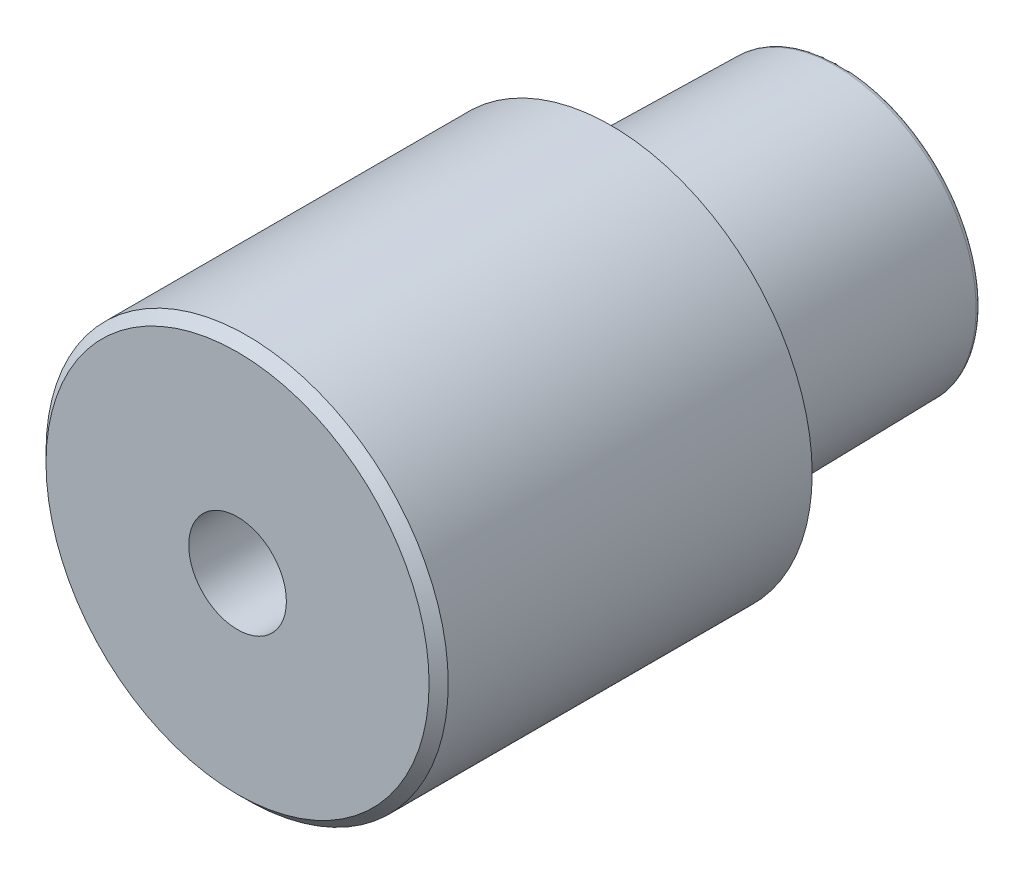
ISO-10303-21;
HEADER;
FILE_DESCRIPTION(('STEP AP214'),'2;1');
FILE_NAME('part.step','',(''),(''),'','','');
FILE_SCHEMA(('AUTOMOTIVE_DESIGN { 1 0 10303 214 1 1 1 1 }'));
ENDSEC;
DATA;
#1=APPLICATION_CONTEXT('core data for automotive mechanical design processes');
#2=APPLICATION_PROTOCOL_DEFINITION('international standard','automotive_design',2000,#1);
#3=PRODUCT_CONTEXT('',#1,'mechanical');
#4=PRODUCT('Part','Part','',(#3));
#5=PRODUCT_RELATED_PRODUCT_CATEGORY('part','',(#4));
#6=PRODUCT_DEFINITION_FORMATION('','',#4);
#7=PRODUCT_DEFINITION_CONTEXT('part definition',#1,'design');
#8=PRODUCT_DEFINITION('design','',#6,#7);
#9=PRODUCT_DEFINITION_SHAPE('','',#8);
#10=(LENGTH_UNIT() NAMED_UNIT(*) SI_UNIT(.MILLI.,.METRE.));
#11=(NAMED_UNIT(*) PLANE_ANGLE_UNIT() SI_UNIT($,.RADIAN.));
#12=(NAMED_UNIT(*) SI_UNIT($,.STERADIAN.) SOLID_ANGLE_UNIT());
#13=UNCERTAINTY_MEASURE_WITH_UNIT(LENGTH_MEASURE(1.E-05),#10,'distance_accuracy_value','');
#14=(GEOMETRIC_REPRESENTATION_CONTEXT(3) GLOBAL_UNCERTAINTY_ASSIGNED_CONTEXT((#13)) GLOBAL_UNIT_ASSIGNED_CONTEXT((#10,
#11,#12)) REPRESENTATION_CONTEXT('',''));
#15=CARTESIAN_POINT('',(0.,0.,0.));
#16=DIRECTION('',(0.,0.,1.));
#17=DIRECTION('',(1.,0.,0.));
#18=AXIS2_PLACEMENT_3D('',#15,#16,#17);
#19=CARTESIAN_POINT('',(2.11594349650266E-13,0.,30.301515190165));
#20=DIRECTION('',(0.,0.,-1.));
#21=DIRECTION('',(1.,0.,0.));
#22=AXIS2_PLACEMENT_3D('',#19,#20,#21);
#23=CONICAL_SURFACE('',#22,29.698484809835,0.785398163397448);
#24=CARTESIAN_POINT('',(2.7931850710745E-13,0.,40.));
#25=DIRECTION('',(0.,0.,-1.));
#26=DIRECTION('',(-1.,0.,0.));
#27=AXIS2_PLACEMENT_3D('',#24,#25,#26);
#28=CIRCLE('',#27,20.);
#29=CARTESIAN_POINT('',(-19.9999999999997,0.,40.));
#30=VERTEX_POINT('',#29);
#31=CARTESIAN_POINT('',(20.0000000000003,0.,40.));
#32=VERTEX_POINT('',#31);
#33=EDGE_CURVE('E59',#30,#32,#28,.T.);
#34=ORIENTED_EDGE('',*,*,#33,.T.);
#35=CARTESIAN_POINT('',(20.0000025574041,0.,39.9999974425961));
#36=CARTESIAN_POINT('',(21.0000013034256,0.,38.9999986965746));
#37=B_SPLINE_CURVE_WITH_KNOTS('',1,(#35,#36),.UNSPECIFIED.,.F.,.F.,(2,2),(0.673435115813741,
0.707106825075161),.UNSPECIFIED.);
#38=CARTESIAN_POINT('',(21.0000000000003,0.,39.));
#39=VERTEX_POINT('',#38);
#40=EDGE_CURVE('E46',#32,#39,#37,.T.);
#41=ORIENTED_EDGE('',*,*,#40,.T.);
#42=CARTESIAN_POINT('',(2.72335544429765E-13,0.,39.));
#43=DIRECTION('',(0.,0.,1.));
#44=DIRECTION('',(-1.,0.,0.));
#45=AXIS2_PLACEMENT_3D('',#42,#43,#44);
#46=CIRCLE('',#45,21.);
#47=CARTESIAN_POINT('',(-20.9999999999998,0.,39.));
#48=VERTEX_POINT('',#47);
#49=EDGE_CURVE('E97',#39,#48,#46,.T.);
#50=ORIENTED_EDGE('',*,*,#49,.T.);
#51=CARTESIAN_POINT('',(2.72335544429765E-13,0.,39.));
#52=DIRECTION('',(0.,0.,1.));
#53=DIRECTION('',(-1.,0.,0.));
#54=AXIS2_PLACEMENT_3D('',#51,#52,#53);
#55=CIRCLE('',#54,21.);
#56=EDGE_CURVE('E11',#48,#39,#55,.T.);
#57=ORIENTED_EDGE('',*,*,#56,.T.);
#58=ORIENTED_EDGE('',*,*,#40,.F.);
#59=CARTESIAN_POINT('',(2.7931850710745E-13,0.,40.));
#60=DIRECTION('',(0.,0.,-1.));
#61=DIRECTION('',(-1.,0.,0.));
#62=AXIS2_PLACEMENT_3D('',#59,#60,#61);
#63=CIRCLE('',#62,20.);
#64=EDGE_CURVE('E94',#32,#30,#63,.T.);
#65=ORIENTED_EDGE('',*,*,#64,.T.);
#66=EDGE_LOOP('',(#34,#41,#50,#57,#58,#65));
#67=FACE_BOUND('',#66,.T.);
#68=ADVANCED_FACE('F38',(#67),#23,.T.);
#69=CARTESIAN_POINT('',(1.43150734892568E-13,0.,20.5));
#70=DIRECTION('',(0.,0.,-1.));
#71=DIRECTION('',(-1.,0.,0.));
#72=AXIS2_PLACEMENT_3D('',#69,#70,#71);
#73=CYLINDRICAL_SURFACE('',#72,21.);
#74=ORIENTED_EDGE('',*,*,#49,.F.);
#75=ORIENTED_EDGE('',*,*,#56,.F.);
#76=CARTESIAN_POINT('',(-20.9999999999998,0.,39.0000014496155));
#77=CARTESIAN_POINT('',(-21.,0.,1.0000004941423));
#78=B_SPLINE_CURVE_WITH_KNOTS('',1,(#76,#77),.UNSPECIFIED.,.F.,.F.,(2,2),(0.0833333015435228,
0.916666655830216),.UNSPECIFIED.);
#79=CARTESIAN_POINT('',(-21.,0.,1.00000000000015));
#80=VERTEX_POINT('',#79);
#81=EDGE_CURVE('E132',#48,#80,#78,.T.);
#82=ORIENTED_EDGE('',*,*,#81,.T.);
#83=CARTESIAN_POINT('',(0.,0.,1.));
#84=DIRECTION('',(0.,0.,-1.));
#85=DIRECTION('',(-1.,0.,0.));
#86=AXIS2_PLACEMENT_3D('',#83,#84,#85);
#87=CIRCLE('',#86,21.);
#88=EDGE_CURVE('E137',#80,#80,#87,.T.);
#89=ORIENTED_EDGE('',*,*,#88,.F.);
#90=ORIENTED_EDGE('',*,*,#81,.F.);
#91=EDGE_LOOP('',(#74,#75,#82,#89,#90));
#92=FACE_BOUND('',#91,.T.);
#93=ADVANCED_FACE('F182',(#92),#73,.T.);
#94=CARTESIAN_POINT('',(-26.,-41.5692193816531,40.));
#95=DIRECTION('',(0.,0.,1.));
#96=DIRECTION('',(1.,0.,0.));
#97=AXIS2_PLACEMENT_3D('',#94,#95,#96);
#98=PLANE('',#97);
#99=CARTESIAN_POINT('',(0.,0.,39.9999999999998));
#100=DIRECTION('',(0.,0.,1.));
#101=DIRECTION('',(1.,0.,0.));
#102=AXIS2_PLACEMENT_3D('',#99,#100,#101);
#103=CIRCLE('',#102,5.09999999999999);
#104=CARTESIAN_POINT('',(5.09999999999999,0.,39.9999999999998));
#105=VERTEX_POINT('',#104);
#106=EDGE_CURVE('E95',#105,#105,#103,.T.);
#107=ORIENTED_EDGE('',*,*,#106,.F.);
#108=EDGE_LOOP('',(#107));
#109=FACE_BOUND('',#108,.T.);
#110=ORIENTED_EDGE('',*,*,#64,.F.);
#111=ORIENTED_EDGE('',*,*,#33,.F.);
#112=EDGE_LOOP('',(#110,#111));
#113=FACE_BOUND('',#112,.T.);
#114=ADVANCED_FACE('F185',(#109,#113),#98,.T.);
#115=CARTESIAN_POINT('',(-1.57116660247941E-13,0.,-22.5));
#116=DIRECTION('',(0.,0.,-1.));
#117=DIRECTION('',(-1.,0.,0.));
#118=AXIS2_PLACEMENT_3D('',#115,#116,#117);
#119=TOROIDAL_SURFACE('',#118,14.1071848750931,0.5);
#120=CARTESIAN_POINT('',(-1.57177594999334E-13,0.,-22.5087262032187));
#121=DIRECTION('',(0.,0.,-1.));
#122=DIRECTION('',(-1.,0.,0.));
#123=AXIS2_PLACEMENT_3D('',#120,#121,#122);
#124=CIRCLE('',#123,14.6071087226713);
#125=CARTESIAN_POINT('',(-14.6071087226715,0.,-22.5087262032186));
#126=VERTEX_POINT('',#125);
#127=EDGE_CURVE('E138',#126,#126,#124,.T.);
#128=ORIENTED_EDGE('',*,*,#127,.T.);
#129=CARTESIAN_POINT('',(-14.6071087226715,0.,-22.5087262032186));
#130=CARTESIAN_POINT('',(-14.5985335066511,0.,-22.9999999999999));
#131=CARTESIAN_POINT('',(-14.1071848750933,0.,-23.));
#132=(BOUNDED_CURVE() B_SPLINE_CURVE(2,(#129,#130,#131),.UNSPECIFIED.,.F.,
.F.) B_SPLINE_CURVE_WITH_KNOTS((3,3),(0.,0.5),
.UNSPECIFIED.) CURVE() GEOMETRIC_REPRESENTATION_ITEM() RATIONAL_B_SPLINE_CURVE((1.,
0.713250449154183,1.)) REPRESENTATION_ITEM(''));
#133=CARTESIAN_POINT('',(-14.1071848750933,0.,-23.));
#134=VERTEX_POINT('',#133);
#135=EDGE_CURVE('E121',#126,#134,#132,.T.);
#136=ORIENTED_EDGE('',*,*,#135,.T.);
#137=CARTESIAN_POINT('',(-1.60608141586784E-13,0.,-23.));
#138=DIRECTION('',(0.,0.,1.));
#139=DIRECTION('',(-1.,0.,0.));
#140=AXIS2_PLACEMENT_3D('',#137,#138,#139);
#141=CIRCLE('',#140,14.1071848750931);
#142=EDGE_CURVE('E127',#134,#134,#141,.T.);
#143=ORIENTED_EDGE('',*,*,#142,.T.);
#144=ORIENTED_EDGE('',*,*,#135,.F.);
#145=EDGE_LOOP('',(#128,#136,#143,#144));
#146=FACE_BOUND('',#145,.T.);
#147=ADVANCED_FACE('F187',(#146),#119,.T.);
#148=CARTESIAN_POINT('',(0.,0.,0.));
#149=DIRECTION('',(0.,0.,1.));
#150=DIRECTION('',(-1.,0.,0.));
#151=AXIS2_PLACEMENT_3D('',#148,#149,#150);
#152=CONICAL_SURFACE('',#151,15.,0.0174532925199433);
#153=ORIENTED_EDGE('',*,*,#127,.F.);
#154=CARTESIAN_POINT('',(-14.6071087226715,0.,-22.5087262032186));
#155=CARTESIAN_POINT('',(-15.,0.,1.04744440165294E-13));
#156=B_SPLINE_CURVE_WITH_KNOTS('',1,(#154,#155),.UNSPECIFIED.,.F.,.F.,(2,2),(0.,1.),.UNSPECIFIED.);
#157=CARTESIAN_POINT('',(-15.,0.,1.04744440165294E-13));
#158=VERTEX_POINT('',#157);
#159=EDGE_CURVE('E110',#126,#158,#156,.T.);
#160=ORIENTED_EDGE('',*,*,#159,.T.);
#161=CARTESIAN_POINT('',(0.,0.,0.));
#162=DIRECTION('',(0.,0.,-1.));
#163=DIRECTION('',(-1.,0.,0.));
#164=AXIS2_PLACEMENT_3D('',#161,#162,#163);
#165=CIRCLE('',#164,15.);
#166=EDGE_CURVE('E116',#158,#158,#165,.T.);
#167=ORIENTED_EDGE('',*,*,#166,.T.);
#168=ORIENTED_EDGE('',*,*,#159,.F.);
#169=EDGE_LOOP('',(#153,#160,#167,#168));
#170=FACE_BOUND('',#169,.T.);
#171=ADVANCED_FACE('F194',(#170),#152,.T.);
#172=CARTESIAN_POINT('',(32.4465252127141,-29.3212331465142,-23.0000000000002));
#173=DIRECTION('',(0.,0.,-1.));
#174=DIRECTION('',(-1.,0.,0.));
#175=AXIS2_PLACEMENT_3D('',#172,#173,#174);
#176=PLANE('',#175);
#177=ORIENTED_EDGE('',*,*,#142,.F.);
#178=EDGE_LOOP('',(#177));
#179=FACE_BOUND('',#178,.T.);
#180=ADVANCED_FACE('F222',(#179),#176,.T.);
#181=CARTESIAN_POINT('',(0.,0.,0.5));
#182=DIRECTION('',(0.,0.,-1.));
#183=DIRECTION('',(-1.,0.,0.));
#184=AXIS2_PLACEMENT_3D('',#181,#182,#183);
#185=CYLINDRICAL_SURFACE('',#184,15.);
#186=CARTESIAN_POINT('',(0.,0.,1.));
#187=DIRECTION('',(0.,0.,1.));
#188=DIRECTION('',(-1.,0.,0.));
#189=AXIS2_PLACEMENT_3D('',#186,#187,#188);
#190=CIRCLE('',#189,15.);
#191=CARTESIAN_POINT('',(-15.,0.,1.0000000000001));
#192=VERTEX_POINT('',#191);
#193=EDGE_CURVE('E105',#192,#192,#190,.T.);
#194=ORIENTED_EDGE('',*,*,#193,.F.);
#195=CARTESIAN_POINT('',(-15.,0.,1.00000305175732));
#196=CARTESIAN_POINT('',(-15.,0.,5.31746980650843E-07));
#197=B_SPLINE_CURVE_WITH_KNOTS('',1,(#195,#196),.UNSPECIFIED.,.F.,.F.,(2,2),(0.0833307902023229,
0.91666622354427),.UNSPECIFIED.);
#198=EDGE_CURVE('E102',#192,#158,#197,.T.);
#199=ORIENTED_EDGE('',*,*,#198,.T.);
#200=ORIENTED_EDGE('',*,*,#166,.F.);
#201=ORIENTED_EDGE('',*,*,#198,.F.);
#202=EDGE_LOOP('',(#194,#199,#200,#201));
#203=FACE_BOUND('',#202,.T.);
#204=ADVANCED_FACE('F231',(#203),#185,.T.);
#205=CARTESIAN_POINT('',(48.3,-43.6476803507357,0.999999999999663));
#206=DIRECTION('',(0.,0.,-1.));
#207=DIRECTION('',(-1.,0.,0.));
#208=AXIS2_PLACEMENT_3D('',#205,#206,#207);
#209=PLANE('',#208);
#210=ORIENTED_EDGE('',*,*,#88,.T.);
#211=EDGE_LOOP('',(#210));
#212=FACE_BOUND('',#211,.T.);
#213=ORIENTED_EDGE('',*,*,#193,.T.);
#214=EDGE_LOOP('',(#213));
#215=FACE_BOUND('',#214,.T.);
#216=ADVANCED_FACE('F88',(#212,#215),#209,.T.);
#217=CARTESIAN_POINT('',(0.,0.,13.9999999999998));
#218=DIRECTION('',(0.,0.,1.));
#219=DIRECTION('',(1.,0.,0.));
#220=AXIS2_PLACEMENT_3D('',#217,#218,#219);
#221=CONICAL_SURFACE('',#220,5.09999999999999,1.02974425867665);
#222=CARTESIAN_POINT('',(0.,0.,10.9356108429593));
#223=VERTEX_POINT('',#222);
#224=VERTEX_LOOP('',#223);
#225=FACE_BOUND('',#224,.T.);
#226=CARTESIAN_POINT('',(0.,0.,13.9999999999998));
#227=DIRECTION('',(0.,0.,1.));
#228=DIRECTION('',(1.,0.,0.));
#229=AXIS2_PLACEMENT_3D('',#226,#227,#228);
#230=CIRCLE('',#229,5.09999999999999);
#231=CARTESIAN_POINT('',(5.09999999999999,0.,13.9999999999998));
#232=VERTEX_POINT('',#231);
#233=EDGE_CURVE('E92',#232,#232,#230,.T.);
#234=ORIENTED_EDGE('',*,*,#233,.T.);
#235=EDGE_LOOP('',(#234));
#236=FACE_BOUND('',#235,.T.);
#237=ADVANCED_FACE('F84',(#225,#236),#221,.F.);
#238=CARTESIAN_POINT('',(0.,0.,39.9999999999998));
#239=DIRECTION('',(0.,0.,1.));
#240=DIRECTION('',(1.,0.,0.));
#241=AXIS2_PLACEMENT_3D('',#238,#239,#240);
#242=CYLINDRICAL_SURFACE('',#241,5.09999999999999);
#243=ORIENTED_EDGE('',*,*,#233,.F.);
#244=EDGE_LOOP('',(#243));
#245=FACE_BOUND('',#244,.T.);
#246=ORIENTED_EDGE('',*,*,#106,.T.);
#247=EDGE_LOOP('',(#246));
#248=FACE_BOUND('',#247,.T.);
#249=ADVANCED_FACE('F87',(#245,#248),#242,.F.);
#250=CLOSED_SHELL('',(#68,#93,#114,#147,#171,#180,#204,#216,#237,#249));
#251=MANIFOLD_SOLID_BREP('B2',#250);
#252=ADVANCED_BREP_SHAPE_REPRESENTATION('',(#18,#251),#14);
#253=SHAPE_DEFINITION_REPRESENTATION(#9,#252);
ENDSEC;
END-ISO-10303-21;
